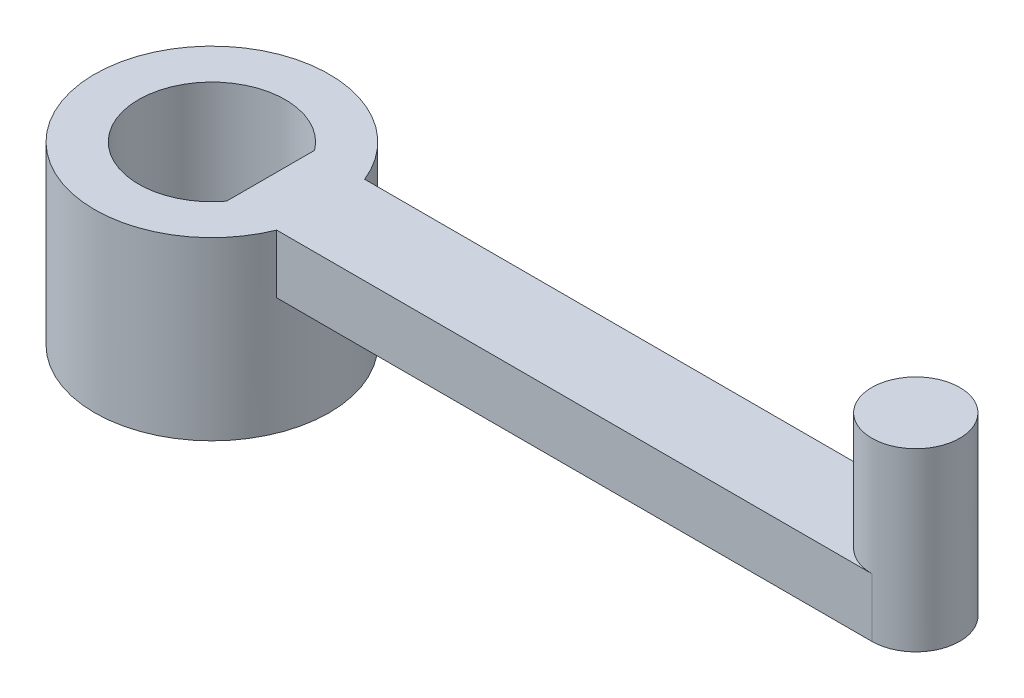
ISO-10303-21;
HEADER;
FILE_DESCRIPTION(('STEP AP214'),'2;1');
FILE_NAME('part.step','',(''),(''),'','','');
FILE_SCHEMA(('AUTOMOTIVE_DESIGN { 1 0 10303 214 1 1 1 1 }'));
ENDSEC;
DATA;
#1=APPLICATION_CONTEXT('core data for automotive mechanical design processes');
#2=APPLICATION_PROTOCOL_DEFINITION('international standard','automotive_design',2000,#1);
#3=PRODUCT_CONTEXT('',#1,'mechanical');
#4=PRODUCT('Part','Part','',(#3));
#5=PRODUCT_RELATED_PRODUCT_CATEGORY('part','',(#4));
#6=PRODUCT_DEFINITION_FORMATION('','',#4);
#7=PRODUCT_DEFINITION_CONTEXT('part definition',#1,'design');
#8=PRODUCT_DEFINITION('design','',#6,#7);
#9=PRODUCT_DEFINITION_SHAPE('','',#8);
#10=(LENGTH_UNIT() NAMED_UNIT(*) SI_UNIT(.MILLI.,.METRE.));
#11=(NAMED_UNIT(*) PLANE_ANGLE_UNIT() SI_UNIT($,.RADIAN.));
#12=(NAMED_UNIT(*) SI_UNIT($,.STERADIAN.) SOLID_ANGLE_UNIT());
#13=UNCERTAINTY_MEASURE_WITH_UNIT(LENGTH_MEASURE(1.E-05),#10,'distance_accuracy_value','');
#14=(GEOMETRIC_REPRESENTATION_CONTEXT(3) GLOBAL_UNCERTAINTY_ASSIGNED_CONTEXT((#13)) GLOBAL_UNIT_ASSIGNED_CONTEXT((#10,
#11,#12)) REPRESENTATION_CONTEXT('',''));
#15=CARTESIAN_POINT('',(0.,0.,0.));
#16=DIRECTION('',(0.,0.,1.));
#17=DIRECTION('',(1.,0.,0.));
#18=AXIS2_PLACEMENT_3D('',#15,#16,#17);
#19=CARTESIAN_POINT('',(0.,-6.35,4.7625));
#20=DIRECTION('',(0.,0.,1.));
#21=DIRECTION('',(1.,0.,0.));
#22=AXIS2_PLACEMENT_3D('',#19,#20,#21);
#23=PLANE('',#22);
#24=DIRECTION('',(1.,0.,0.));
#25=VECTOR('',#24,1.);
#26=CARTESIAN_POINT('',(0.,0.,4.7625));
#27=LINE('',#26,#25);
#28=CARTESIAN_POINT('',(11.7732150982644,0.,4.7625));
#29=VERTEX_POINT('',#28);
#30=CARTESIAN_POINT('',(76.2,0.,4.7625));
#31=VERTEX_POINT('',#30);
#32=EDGE_CURVE('E112',#29,#31,#27,.T.);
#33=ORIENTED_EDGE('',*,*,#32,.F.);
#34=DIRECTION('',(0.,1.,0.));
#35=VECTOR('',#34,1.);
#36=CARTESIAN_POINT('',(11.7732150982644,-6.35,4.7625));
#37=LINE('',#36,#35);
#38=CARTESIAN_POINT('',(11.7732150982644,-6.35,4.7625));
#39=VERTEX_POINT('',#38);
#40=EDGE_CURVE('E43',#39,#29,#37,.T.);
#41=ORIENTED_EDGE('',*,*,#40,.F.);
#42=DIRECTION('',(1.,0.,0.));
#43=VECTOR('',#42,1.);
#44=CARTESIAN_POINT('',(0.,-6.35,4.7625));
#45=LINE('',#44,#43);
#46=CARTESIAN_POINT('',(76.2,-6.35,4.7625));
#47=VERTEX_POINT('',#46);
#48=EDGE_CURVE('E102',#39,#47,#45,.T.);
#49=ORIENTED_EDGE('',*,*,#48,.T.);
#50=DIRECTION('',(0.,1.,0.));
#51=VECTOR('',#50,1.);
#52=CARTESIAN_POINT('',(76.2,-6.35,4.7625));
#53=LINE('',#52,#51);
#54=EDGE_CURVE('E97',#47,#31,#53,.T.);
#55=ORIENTED_EDGE('',*,*,#54,.T.);
#56=EDGE_LOOP('',(#33,#41,#49,#55));
#57=FACE_BOUND('',#56,.T.);
#58=ADVANCED_FACE('F34',(#57),#23,.T.);
#59=CARTESIAN_POINT('',(0.,-6.35,-4.7625));
#60=DIRECTION('',(0.,0.,1.));
#61=DIRECTION('',(1.,0.,0.));
#62=AXIS2_PLACEMENT_3D('',#59,#60,#61);
#63=PLANE('',#62);
#64=DIRECTION('',(1.,0.,0.));
#65=VECTOR('',#64,1.);
#66=CARTESIAN_POINT('',(0.,0.,-4.7625));
#67=LINE('',#66,#65);
#68=CARTESIAN_POINT('',(11.7732150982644,0.,-4.7625));
#69=VERTEX_POINT('',#68);
#70=CARTESIAN_POINT('',(76.2,0.,-4.7625));
#71=VERTEX_POINT('',#70);
#72=EDGE_CURVE('E69',#69,#71,#67,.T.);
#73=ORIENTED_EDGE('',*,*,#72,.T.);
#74=DIRECTION('',(0.,1.,0.));
#75=VECTOR('',#74,1.);
#76=CARTESIAN_POINT('',(76.2,-6.35,-4.7625));
#77=LINE('',#76,#75);
#78=CARTESIAN_POINT('',(76.2,-6.35,-4.7625));
#79=VERTEX_POINT('',#78);
#80=EDGE_CURVE('E93',#79,#71,#77,.T.);
#81=ORIENTED_EDGE('',*,*,#80,.F.);
#82=DIRECTION('',(1.,0.,0.));
#83=VECTOR('',#82,1.);
#84=CARTESIAN_POINT('',(0.,-6.35,-4.7625));
#85=LINE('',#84,#83);
#86=CARTESIAN_POINT('',(11.7732150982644,-6.35,-4.7625));
#87=VERTEX_POINT('',#86);
#88=EDGE_CURVE('E83',#87,#79,#85,.T.);
#89=ORIENTED_EDGE('',*,*,#88,.F.);
#90=DIRECTION('',(0.,1.,0.));
#91=VECTOR('',#90,1.);
#92=CARTESIAN_POINT('',(11.7732150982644,-6.35,-4.7625));
#93=LINE('',#92,#91);
#94=EDGE_CURVE('E96',#87,#69,#93,.T.);
#95=ORIENTED_EDGE('',*,*,#94,.T.);
#96=EDGE_LOOP('',(#73,#81,#89,#95));
#97=FACE_BOUND('',#96,.T.);
#98=ADVANCED_FACE('F94',(#97),#63,.F.);
#99=CARTESIAN_POINT('',(76.2,-6.35,0.));
#100=DIRECTION('',(0.,1.,0.));
#101=DIRECTION('',(0.,0.,1.));
#102=AXIS2_PLACEMENT_3D('',#99,#100,#101);
#103=CYLINDRICAL_SURFACE('',#102,4.7625);
#104=ORIENTED_EDGE('',*,*,#80,.T.);
#105=CARTESIAN_POINT('',(76.2,0.,0.));
#106=DIRECTION('',(0.,1.,0.));
#107=DIRECTION('',(0.,0.,1.));
#108=AXIS2_PLACEMENT_3D('',#105,#106,#107);
#109=CIRCLE('',#108,4.7625);
#110=EDGE_CURVE('E11',#71,#31,#109,.T.);
#111=ORIENTED_EDGE('',*,*,#110,.T.);
#112=ORIENTED_EDGE('',*,*,#54,.F.);
#113=CARTESIAN_POINT('',(76.2,-6.35,0.));
#114=DIRECTION('',(0.,1.,0.));
#115=DIRECTION('',(0.,0.,1.));
#116=AXIS2_PLACEMENT_3D('',#113,#114,#115);
#117=CIRCLE('',#116,4.7625);
#118=EDGE_CURVE('E87',#47,#79,#117,.T.);
#119=ORIENTED_EDGE('',*,*,#118,.T.);
#120=EDGE_LOOP('',(#104,#111,#112,#119));
#121=FACE_BOUND('',#120,.T.);
#122=CARTESIAN_POINT('',(76.2,12.7,0.));
#123=DIRECTION('',(0.,1.,0.));
#124=DIRECTION('',(0.,0.,1.));
#125=AXIS2_PLACEMENT_3D('',#122,#123,#124);
#126=CIRCLE('',#125,4.7625);
#127=CARTESIAN_POINT('',(76.2,12.7,4.7625));
#128=VERTEX_POINT('',#127);
#129=EDGE_CURVE('E140',#128,#128,#126,.T.);
#130=ORIENTED_EDGE('',*,*,#129,.F.);
#131=EDGE_LOOP('',(#130));
#132=FACE_BOUND('',#131,.T.);
#133=ADVANCED_FACE('F99',(#121,#132),#103,.T.);
#134=CARTESIAN_POINT('',(0.,-6.35,0.));
#135=DIRECTION('',(0.,1.,0.));
#136=DIRECTION('',(0.,0.,1.));
#137=AXIS2_PLACEMENT_3D('',#134,#135,#136);
#138=PLANE('',#137);
#139=ORIENTED_EDGE('',*,*,#48,.F.);
#140=CARTESIAN_POINT('',(0.,-6.35,0.));
#141=DIRECTION('',(0.,1.,0.));
#142=DIRECTION('',(0.,0.,1.));
#143=AXIS2_PLACEMENT_3D('',#140,#141,#142);
#144=CIRCLE('',#143,12.7);
#145=EDGE_CURVE('E89',#39,#87,#144,.T.);
#146=ORIENTED_EDGE('',*,*,#145,.T.);
#147=ORIENTED_EDGE('',*,*,#88,.T.);
#148=ORIENTED_EDGE('',*,*,#118,.F.);
#149=EDGE_LOOP('',(#139,#146,#147,#148));
#150=FACE_BOUND('',#149,.T.);
#151=ADVANCED_FACE('F85',(#150),#138,.F.);
#152=CARTESIAN_POINT('',(0.,0.,0.));
#153=DIRECTION('',(0.,1.,0.));
#154=DIRECTION('',(0.,0.,1.));
#155=AXIS2_PLACEMENT_3D('',#152,#153,#154);
#156=PLANE('',#155);
#157=ORIENTED_EDGE('',*,*,#110,.F.);
#158=ORIENTED_EDGE('',*,*,#72,.F.);
#159=CARTESIAN_POINT('',(0.,0.,0.));
#160=DIRECTION('',(0.,1.,0.));
#161=DIRECTION('',(0.,0.,1.));
#162=AXIS2_PLACEMENT_3D('',#159,#160,#161);
#163=CIRCLE('',#162,12.7);
#164=EDGE_CURVE('E138',#69,#29,#163,.T.);
#165=ORIENTED_EDGE('',*,*,#164,.T.);
#166=ORIENTED_EDGE('',*,*,#32,.T.);
#167=EDGE_LOOP('',(#157,#158,#165,#166));
#168=FACE_BOUND('',#167,.T.);
#169=CARTESIAN_POINT('',(0.,0.,0.));
#170=DIRECTION('',(0.,1.,0.));
#171=DIRECTION('',(0.,0.,1.));
#172=AXIS2_PLACEMENT_3D('',#169,#170,#171);
#173=CIRCLE('',#172,7.9375);
#174=CARTESIAN_POINT('',(6.35,0.,-4.7625));
#175=VERTEX_POINT('',#174);
#176=CARTESIAN_POINT('',(6.35,0.,4.7625));
#177=VERTEX_POINT('',#176);
#178=EDGE_CURVE('E136',#175,#177,#173,.T.);
#179=ORIENTED_EDGE('',*,*,#178,.F.);
#180=DIRECTION('',(0.,0.,1.));
#181=VECTOR('',#180,1.);
#182=CARTESIAN_POINT('',(6.35,0.,0.));
#183=LINE('',#182,#181);
#184=EDGE_CURVE('E132',#175,#177,#183,.T.);
#185=ORIENTED_EDGE('',*,*,#184,.T.);
#186=EDGE_LOOP('',(#179,#185));
#187=FACE_BOUND('',#186,.T.);
#188=ADVANCED_FACE('F155',(#168,#187),#156,.T.);
#189=CARTESIAN_POINT('',(0.,-19.05,0.));
#190=DIRECTION('',(0.,1.,0.));
#191=DIRECTION('',(0.,0.,1.));
#192=AXIS2_PLACEMENT_3D('',#189,#190,#191);
#193=CYLINDRICAL_SURFACE('',#192,7.9375);
#194=ORIENTED_EDGE('',*,*,#178,.T.);
#195=DIRECTION('',(0.,1.,0.));
#196=VECTOR('',#195,1.);
#197=CARTESIAN_POINT('',(6.35,-19.05,4.7625));
#198=LINE('',#197,#196);
#199=CARTESIAN_POINT('',(6.35,-19.05,4.7625));
#200=VERTEX_POINT('',#199);
#201=EDGE_CURVE('E119',#200,#177,#198,.T.);
#202=ORIENTED_EDGE('',*,*,#201,.F.);
#203=CARTESIAN_POINT('',(0.,-19.05,0.));
#204=DIRECTION('',(0.,1.,0.));
#205=DIRECTION('',(0.,0.,1.));
#206=AXIS2_PLACEMENT_3D('',#203,#204,#205);
#207=CIRCLE('',#206,7.9375);
#208=CARTESIAN_POINT('',(6.35,-19.05,-4.7625));
#209=VERTEX_POINT('',#208);
#210=EDGE_CURVE('E142',#209,#200,#207,.T.);
#211=ORIENTED_EDGE('',*,*,#210,.F.);
#212=DIRECTION('',(0.,1.,0.));
#213=VECTOR('',#212,1.);
#214=CARTESIAN_POINT('',(6.35,-19.05,-4.7625));
#215=LINE('',#214,#213);
#216=EDGE_CURVE('E122',#209,#175,#215,.T.);
#217=ORIENTED_EDGE('',*,*,#216,.T.);
#218=EDGE_LOOP('',(#194,#202,#211,#217));
#219=FACE_BOUND('',#218,.T.);
#220=ADVANCED_FACE('F167',(#219),#193,.F.);
#221=CARTESIAN_POINT('',(0.,-19.05,0.));
#222=DIRECTION('',(0.,1.,0.));
#223=DIRECTION('',(0.,0.,1.));
#224=AXIS2_PLACEMENT_3D('',#221,#222,#223);
#225=CYLINDRICAL_SURFACE('',#224,12.7);
#226=ORIENTED_EDGE('',*,*,#145,.F.);
#227=ORIENTED_EDGE('',*,*,#40,.T.);
#228=ORIENTED_EDGE('',*,*,#164,.F.);
#229=ORIENTED_EDGE('',*,*,#94,.F.);
#230=EDGE_LOOP('',(#226,#227,#228,#229));
#231=FACE_BOUND('',#230,.T.);
#232=CARTESIAN_POINT('',(0.,-19.05,0.));
#233=DIRECTION('',(0.,1.,0.));
#234=DIRECTION('',(0.,0.,1.));
#235=AXIS2_PLACEMENT_3D('',#232,#233,#234);
#236=CIRCLE('',#235,12.7);
#237=CARTESIAN_POINT('',(0.,-19.05,12.7));
#238=VERTEX_POINT('',#237);
#239=EDGE_CURVE('E135',#238,#238,#236,.T.);
#240=ORIENTED_EDGE('',*,*,#239,.T.);
#241=EDGE_LOOP('',(#240));
#242=FACE_BOUND('',#241,.T.);
#243=ADVANCED_FACE('F163',(#231,#242),#225,.T.);
#244=CARTESIAN_POINT('',(6.35,-19.05,0.));
#245=DIRECTION('',(-1.,0.,0.));
#246=DIRECTION('',(0.,0.,1.));
#247=AXIS2_PLACEMENT_3D('',#244,#245,#246);
#248=PLANE('',#247);
#249=ORIENTED_EDGE('',*,*,#184,.F.);
#250=ORIENTED_EDGE('',*,*,#216,.F.);
#251=DIRECTION('',(0.,0.,1.));
#252=VECTOR('',#251,1.);
#253=CARTESIAN_POINT('',(6.35,-19.05,0.));
#254=LINE('',#253,#252);
#255=EDGE_CURVE('E130',#209,#200,#254,.T.);
#256=ORIENTED_EDGE('',*,*,#255,.T.);
#257=ORIENTED_EDGE('',*,*,#201,.T.);
#258=EDGE_LOOP('',(#249,#250,#256,#257));
#259=FACE_BOUND('',#258,.T.);
#260=ADVANCED_FACE('F173',(#259),#248,.T.);
#261=CARTESIAN_POINT('',(0.,-19.05,0.));
#262=DIRECTION('',(0.,1.,0.));
#263=DIRECTION('',(0.,0.,1.));
#264=AXIS2_PLACEMENT_3D('',#261,#262,#263);
#265=PLANE('',#264);
#266=ORIENTED_EDGE('',*,*,#239,.F.);
#267=EDGE_LOOP('',(#266));
#268=FACE_BOUND('',#267,.T.);
#269=ORIENTED_EDGE('',*,*,#210,.T.);
#270=ORIENTED_EDGE('',*,*,#255,.F.);
#271=EDGE_LOOP('',(#269,#270));
#272=FACE_BOUND('',#271,.T.);
#273=ADVANCED_FACE('F178',(#268,#272),#265,.F.);
#274=CARTESIAN_POINT('',(0.,12.7,0.));
#275=DIRECTION('',(0.,1.,0.));
#276=DIRECTION('',(0.,0.,1.));
#277=AXIS2_PLACEMENT_3D('',#274,#275,#276);
#278=PLANE('',#277);
#279=ORIENTED_EDGE('',*,*,#129,.T.);
#280=EDGE_LOOP('',(#279));
#281=FACE_BOUND('',#280,.T.);
#282=ADVANCED_FACE('F149',(#281),#278,.T.);
#283=CLOSED_SHELL('',(#58,#98,#133,#151,#188,#220,#243,#260,#273,#282));
#284=MANIFOLD_SOLID_BREP('B2',#283);
#285=ADVANCED_BREP_SHAPE_REPRESENTATION('',(#18,#284),#14);
#286=SHAPE_DEFINITION_REPRESENTATION(#9,#285);
ENDSEC;
END-ISO-10303-21;
